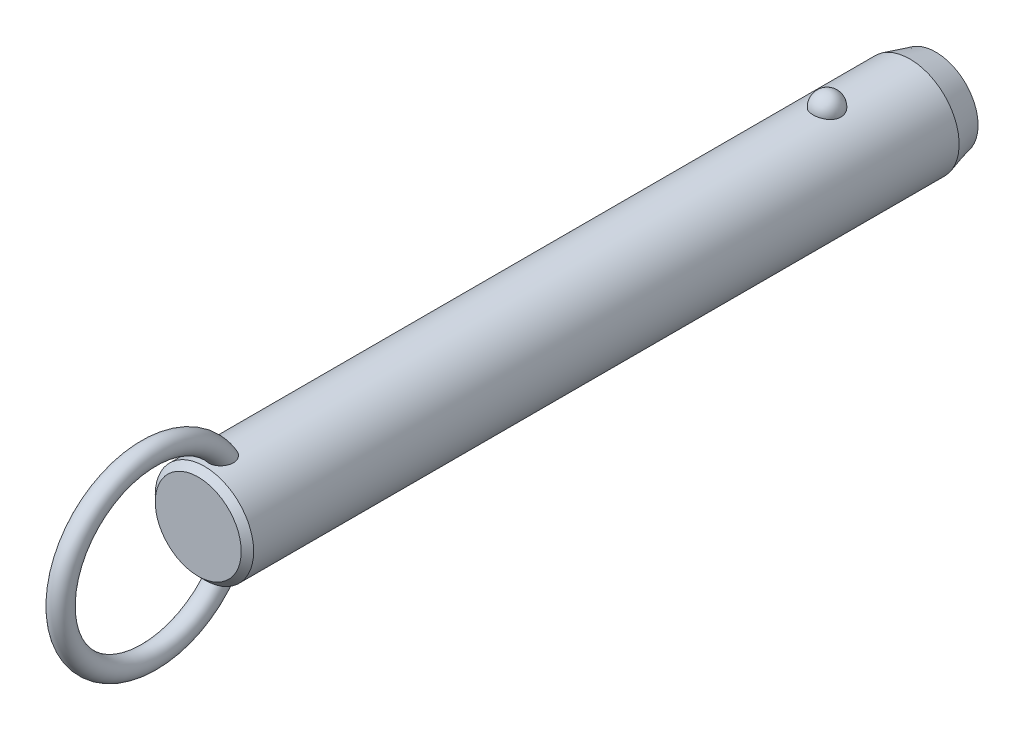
ISO-10303-21;
HEADER;
FILE_DESCRIPTION(('STEP AP214'),'2;1');
FILE_NAME('part.step','',(''),(''),'','','');
FILE_SCHEMA(('AUTOMOTIVE_DESIGN { 1 0 10303 214 1 1 1 1 }'));
ENDSEC;
DATA;
#1=APPLICATION_CONTEXT('core data for automotive mechanical design processes');
#2=APPLICATION_PROTOCOL_DEFINITION('international standard','automotive_design',2000,#1);
#3=PRODUCT_CONTEXT('',#1,'mechanical');
#4=PRODUCT('Part','Part','',(#3));
#5=PRODUCT_RELATED_PRODUCT_CATEGORY('part','',(#4));
#6=PRODUCT_DEFINITION_FORMATION('','',#4);
#7=PRODUCT_DEFINITION_CONTEXT('part definition',#1,'design');
#8=PRODUCT_DEFINITION('design','',#6,#7);
#9=PRODUCT_DEFINITION_SHAPE('','',#8);
#10=(LENGTH_UNIT() NAMED_UNIT(*) SI_UNIT(.MILLI.,.METRE.));
#11=(NAMED_UNIT(*) PLANE_ANGLE_UNIT() SI_UNIT($,.RADIAN.));
#12=(NAMED_UNIT(*) SI_UNIT($,.STERADIAN.) SOLID_ANGLE_UNIT());
#13=UNCERTAINTY_MEASURE_WITH_UNIT(LENGTH_MEASURE(1.E-05),#10,'distance_accuracy_value','');
#14=(GEOMETRIC_REPRESENTATION_CONTEXT(3) GLOBAL_UNCERTAINTY_ASSIGNED_CONTEXT((#13)) GLOBAL_UNIT_ASSIGNED_CONTEXT((#10,
#11,#12)) REPRESENTATION_CONTEXT('',''));
#15=CARTESIAN_POINT('',(0.,0.,0.));
#16=DIRECTION('',(0.,0.,1.));
#17=DIRECTION('',(1.,0.,0.));
#18=AXIS2_PLACEMENT_3D('',#15,#16,#17);
#19=CARTESIAN_POINT('',(0.,0.,109.2));
#20=DIRECTION('',(0.,0.,-1.));
#21=DIRECTION('',(-1.,0.,0.));
#22=AXIS2_PLACEMENT_3D('',#19,#20,#21);
#23=CYLINDRICAL_SURFACE('',#22,9.5);
#24=CARTESIAN_POINT('',(2.67259918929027,9.11631578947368,-2.70000000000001));
#25=CARTESIAN_POINT('',(2.6725968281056,9.11631786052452,-2.54909854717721));
#26=CARTESIAN_POINT('',(2.66030567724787,9.11994722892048,-2.39816735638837));
#27=CARTESIAN_POINT('',(2.6114347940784,9.13405924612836,-2.10058568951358));
#28=CARTESIAN_POINT('',(2.57484658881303,9.14454428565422,-1.95393672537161));
#29=CARTESIAN_POINT('',(2.47830875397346,9.17117631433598,-1.66916069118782));
#30=CARTESIAN_POINT('',(2.41836936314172,9.18732082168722,-1.53102991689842));
#31=CARTESIAN_POINT('',(2.27661331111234,9.22346780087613,-1.26705393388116));
#32=CARTESIAN_POINT('',(2.19479699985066,9.24347021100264,-1.14120852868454));
#33=CARTESIAN_POINT('',(2.01085282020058,9.28522401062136,-0.904632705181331));
#34=CARTESIAN_POINT('',(1.90862396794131,9.30698376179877,-0.793982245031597));
#35=CARTESIAN_POINT('',(1.6867437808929,9.34973971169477,-0.591607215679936));
#36=CARTESIAN_POINT('',(1.56709244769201,9.37073591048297,-0.499882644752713));
#37=CARTESIAN_POINT('',(1.31393976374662,9.40956370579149,-0.338167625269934));
#38=CARTESIAN_POINT('',(1.18048026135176,9.42740444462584,-0.268113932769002));
#39=CARTESIAN_POINT('',(0.903154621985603,9.45799906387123,-0.151390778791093));
#40=CARTESIAN_POINT('',(0.759289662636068,9.47075351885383,-0.104718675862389));
#41=CARTESIAN_POINT('',(0.468074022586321,9.48956256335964,-0.0367633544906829));
#42=CARTESIAN_POINT('',(0.320836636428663,9.49573643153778,-0.0150275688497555));
#43=CARTESIAN_POINT('',(0.0246714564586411,9.50112183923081,0.00396199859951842));
#44=CARTESIAN_POINT('',(-0.124256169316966,9.50033406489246,0.00121819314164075));
#45=CARTESIAN_POINT('',(-0.417264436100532,9.4919475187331,-0.0284441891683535));
#46=CARTESIAN_POINT('',(-0.56138413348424,9.48444885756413,-0.0550074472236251));
#47=CARTESIAN_POINT('',(-0.842986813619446,9.46357853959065,-0.131064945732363));
#48=CARTESIAN_POINT('',(-0.980469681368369,9.450206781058,-0.180559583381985));
#49=CARTESIAN_POINT('',(-1.24585005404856,9.41890822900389,-0.301476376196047));
#50=CARTESIAN_POINT('',(-1.37368611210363,9.40095498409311,-0.373026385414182));
#51=CARTESIAN_POINT('',(-1.61552738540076,9.36242964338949,-0.536025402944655));
#52=CARTESIAN_POINT('',(-1.72953116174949,9.34185727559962,-0.627476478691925));
#53=CARTESIAN_POINT('',(-1.9429225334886,9.29984568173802,-0.829844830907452));
#54=CARTESIAN_POINT('',(-2.04198021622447,9.27839736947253,-0.94110821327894));
#55=CARTESIAN_POINT('',(-2.22026460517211,9.23735994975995,-1.17883414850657));
#56=CARTESIAN_POINT('',(-2.29948985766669,9.21777097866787,-1.30529781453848));
#57=CARTESIAN_POINT('',(-2.43697287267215,9.18238994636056,-1.57158566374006));
#58=CARTESIAN_POINT('',(-2.49497068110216,9.16664569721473,-1.71155057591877));
#59=CARTESIAN_POINT('',(-2.5872073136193,9.14104303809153,-1.99961197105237));
#60=CARTESIAN_POINT('',(-2.62144683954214,9.13118445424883,-2.14770821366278));
#61=CARTESIAN_POINT('',(-2.66521466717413,9.11850622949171,-2.44715424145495));
#62=CARTESIAN_POINT('',(-2.67484831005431,9.11565658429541,-2.59848735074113));
#63=CARTESIAN_POINT('',(-2.66946735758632,9.11723375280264,-2.90067317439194));
#64=CARTESIAN_POINT('',(-2.65445345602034,9.12166036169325,-3.05152590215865));
#65=CARTESIAN_POINT('',(-2.60029711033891,9.13724422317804,-3.34766110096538));
#66=CARTESIAN_POINT('',(-2.56127978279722,9.14836656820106,-3.49296833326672));
#67=CARTESIAN_POINT('',(-2.46018844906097,9.17606676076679,-3.77477535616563));
#68=CARTESIAN_POINT('',(-2.39811349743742,9.1926448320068,-3.9112747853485));
#69=CARTESIAN_POINT('',(-2.25202303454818,9.22952198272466,-4.17244273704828));
#70=CARTESIAN_POINT('',(-2.16788714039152,9.24984129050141,-4.29704106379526));
#71=CARTESIAN_POINT('',(-1.9799408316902,9.29188255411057,-4.53013066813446));
#72=CARTESIAN_POINT('',(-1.87612963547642,9.31360456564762,-4.63862130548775));
#73=CARTESIAN_POINT('',(-1.65105429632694,9.35612959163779,-4.8369029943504));
#74=CARTESIAN_POINT('',(-1.52972405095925,9.37692871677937,-4.92661991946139));
#75=CARTESIAN_POINT('',(-1.27318250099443,9.41518970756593,-5.08429106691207));
#76=CARTESIAN_POINT('',(-1.13797219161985,9.432651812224,-5.15224684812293));
#77=CARTESIAN_POINT('',(-0.859280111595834,9.46208255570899,-5.26371827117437));
#78=CARTESIAN_POINT('',(-0.715925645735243,9.47411833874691,-5.30753421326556));
#79=CARTESIAN_POINT('',(-0.423550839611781,9.4916822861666,-5.37076321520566));
#80=CARTESIAN_POINT('',(-0.2745312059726,9.49721125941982,-5.39017930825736));
#81=CARTESIAN_POINT('',(0.0218446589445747,9.50110860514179,-5.40390587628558));
#82=CARTESIAN_POINT('',(0.16917707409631,9.49961381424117,-5.39869609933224));
#83=CARTESIAN_POINT('',(0.460808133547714,9.48993906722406,-5.36441955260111));
#84=CARTESIAN_POINT('',(0.605106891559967,9.48175936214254,-5.33535367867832));
#85=CARTESIAN_POINT('',(0.886027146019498,9.4596376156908,-5.25435587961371));
#86=CARTESIAN_POINT('',(1.02267710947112,9.44571881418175,-5.20251612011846));
#87=CARTESIAN_POINT('',(1.28523827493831,9.41358993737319,-5.07741549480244));
#88=CARTESIAN_POINT('',(1.41114877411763,9.39537958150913,-5.00415322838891));
#89=CARTESIAN_POINT('',(1.65085227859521,9.3562644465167,-4.83684599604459));
#90=CARTESIAN_POINT('',(1.76442346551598,9.33532178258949,-4.74249218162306));
#91=CARTESIAN_POINT('',(1.97425672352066,9.29321198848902,-4.53620389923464));
#92=CARTESIAN_POINT('',(2.07051582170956,9.27204482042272,-4.42426641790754));
#93=CARTESIAN_POINT('',(2.24490086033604,9.23139221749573,-4.18363183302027));
#94=CARTESIAN_POINT('',(2.32267019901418,9.21194380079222,-4.05466990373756));
#95=CARTESIAN_POINT('',(2.45584092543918,9.1773419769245,-3.78517836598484));
#96=CARTESIAN_POINT('',(2.5112497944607,9.16218713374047,-3.64465264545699));
#97=CARTESIAN_POINT('',(2.59380876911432,9.13913522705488,-3.37104301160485));
#98=CARTESIAN_POINT('',(2.62330266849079,9.13064624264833,-3.23871053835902));
#99=CARTESIAN_POINT('',(2.66269870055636,9.11923566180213,-2.97092664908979));
#100=CARTESIAN_POINT('',(2.67260130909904,9.11631393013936,-2.83547530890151));
#101=CARTESIAN_POINT('',(2.67259918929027,9.11631578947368,-2.70000000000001));
#102=B_SPLINE_CURVE_WITH_KNOTS('',3,(#24,#25,#26,#27,#28,#29,#30,#31,#32,#33,#34,#35,#36,#37,
#38,#39,#40,#41,#42,#43,#44,#45,#46,#47,#48,#49,#50,#51,#52,#53,#54,#55,#56,#57,#58,#59,#60,#61,
#62,#63,#64,#65,#66,#67,#68,#69,#70,#71,#72,#73,#74,#75,#76,#77,#78,#79,#80,#81,#82,#83,#84,#85,
#86,#87,#88,#89,#90,#91,#92,#93,#94,#95,#96,#97,#98,#99,#100,#101),.UNSPECIFIED.,.T.,.F.,(4,2,2,
2,2,2,2,2,2,2,2,2,2,2,2,2,2,2,2,2,2,2,2,2,2,2,2,2,2,2,2,2,2,2,2,2,2,2,4),(0.,0.452217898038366,
0.904593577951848,1.35677112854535,1.80894144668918,2.26340676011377,2.71787203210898,
3.17099820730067,3.62407318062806,4.0687883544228,4.51345969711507,4.95160616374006,
5.38976021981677,5.83050358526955,6.27129275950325,6.72071308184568,7.17016633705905,
7.62495278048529,8.07972578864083,8.53254856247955,8.98535859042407,9.43582813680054,
9.88631615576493,10.3393155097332,10.7923328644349,11.2471065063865,11.7018475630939,
12.150795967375,12.599688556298,13.0398725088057,13.4800399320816,13.9184421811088,
14.3568730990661,14.802202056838,15.2476074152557,15.7010097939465,16.1542603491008,
16.5602594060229,16.966248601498),.UNSPECIFIED.);
#103=CARTESIAN_POINT('',(2.67259918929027,9.11631578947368,-2.70000000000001));
#104=VERTEX_POINT('',#103);
#105=EDGE_CURVE('E41',#104,#104,#102,.T.);
#106=ORIENTED_EDGE('',*,*,#105,.T.);
#107=EDGE_LOOP('',(#106));
#108=FACE_BOUND('',#107,.T.);
#109=CARTESIAN_POINT('',(0.,0.,117.52));
#110=DIRECTION('',(0.,0.,1.));
#111=DIRECTION('',(1.,0.,0.));
#112=AXIS2_PLACEMENT_3D('',#109,#110,#111);
#113=CIRCLE('',#112,9.5);
#114=CARTESIAN_POINT('',(9.5,0.,117.52));
#115=VERTEX_POINT('',#114);
#116=EDGE_CURVE('E10',#115,#115,#113,.F.);
#117=ORIENTED_EDGE('',*,*,#116,.T.);
#118=EDGE_LOOP('',(#117));
#119=FACE_BOUND('',#118,.T.);
#120=CARTESIAN_POINT('',(-0.697062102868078,-9.47439269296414,111.867808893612));
#121=CARTESIAN_POINT('',(-0.799579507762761,-9.46685146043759,111.907482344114));
#122=CARTESIAN_POINT('',(-0.898575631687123,-9.45788043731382,111.9559309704));
#123=CARTESIAN_POINT('',(-1.08670047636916,-9.43811593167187,112.068868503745));
#124=CARTESIAN_POINT('',(-1.17583204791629,-9.42732297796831,112.133352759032));
#125=CARTESIAN_POINT('',(-1.34179806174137,-9.40513672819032,112.276209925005));
#126=CARTESIAN_POINT('',(-1.41865133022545,-9.39374438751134,112.354561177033));
#127=CARTESIAN_POINT('',(-1.55860047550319,-9.37154196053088,112.522752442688));
#128=CARTESIAN_POINT('',(-1.62169476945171,-9.3607319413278,112.61259377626));
#129=CARTESIAN_POINT('',(-1.73527695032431,-9.34035749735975,112.804500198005));
#130=CARTESIAN_POINT('',(-1.78522266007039,-9.33085270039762,112.906891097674));
#131=CARTESIAN_POINT('',(-1.86924997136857,-9.3143834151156,113.118148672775));
#132=CARTESIAN_POINT('',(-1.90332570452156,-9.30741986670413,113.227017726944));
#133=CARTESIAN_POINT('',(-1.95893603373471,-9.29588482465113,113.460473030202));
#134=CARTESIAN_POINT('',(-1.97872420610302,-9.29165182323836,113.585489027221));
#135=CARTESIAN_POINT('',(-2.00062129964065,-9.28695978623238,113.837080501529));
#136=CARTESIAN_POINT('',(-2.00272284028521,-9.28650232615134,113.963656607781));
#137=CARTESIAN_POINT('',(-1.98958876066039,-9.28932750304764,114.236815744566));
#138=CARTESIAN_POINT('',(-1.97143366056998,-9.2932400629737,114.383251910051));
#139=CARTESIAN_POINT('',(-1.91479925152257,-9.30507151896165,114.672062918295));
#140=CARTESIAN_POINT('',(-1.87629122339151,-9.31299607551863,114.814431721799));
#141=CARTESIAN_POINT('',(-1.7722568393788,-9.33340232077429,115.115172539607));
#142=CARTESIAN_POINT('',(-1.70334898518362,-9.34641636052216,115.272369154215));
#143=CARTESIAN_POINT('',(-1.58111062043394,-9.36759153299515,115.497517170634));
#144=CARTESIAN_POINT('',(-1.53721459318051,-9.37492619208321,115.570796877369));
#145=CARTESIAN_POINT('',(-1.4430263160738,-9.38988566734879,115.71307405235));
#146=CARTESIAN_POINT('',(-1.39273721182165,-9.39751033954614,115.782073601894));
#147=CARTESIAN_POINT('',(-1.26775962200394,-9.41530678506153,115.936983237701));
#148=CARTESIAN_POINT('',(-1.19052326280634,-9.42548108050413,116.020871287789));
#149=CARTESIAN_POINT('',(-1.0242024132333,-9.44499825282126,116.176008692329));
#150=CARTESIAN_POINT('',(-0.935139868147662,-9.45434261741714,116.247280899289));
#151=CARTESIAN_POINT('',(-0.766610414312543,-9.46930670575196,116.358695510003));
#152=CARTESIAN_POINT('',(-0.689439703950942,-9.47529223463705,116.402235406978));
#153=CARTESIAN_POINT('',(-0.528942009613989,-9.48560294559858,116.47631336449));
#154=CARTESIAN_POINT('',(-0.445620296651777,-9.48992953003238,116.506862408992));
#155=CARTESIAN_POINT('',(-0.273901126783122,-9.49644161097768,116.552579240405));
#156=CARTESIAN_POINT('',(-0.185465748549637,-9.49860811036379,116.56761059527));
#157=CARTESIAN_POINT('',(-0.00734541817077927,-9.5004135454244,116.580149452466));
#158=CARTESIAN_POINT('',(0.0823387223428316,-9.50005405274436,116.577667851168));
#159=CARTESIAN_POINT('',(0.247679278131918,-9.49708301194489,116.556995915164));
#160=CARTESIAN_POINT('',(0.32362017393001,-9.49477609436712,116.540930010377));
#161=CARTESIAN_POINT('',(0.47198153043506,-9.48855917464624,116.497172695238));
#162=CARTESIAN_POINT('',(0.54440029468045,-9.48464840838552,116.469475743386));
#163=CARTESIAN_POINT('',(0.708947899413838,-9.47398336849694,116.39280266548));
#164=CARTESIAN_POINT('',(0.799149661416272,-9.46671310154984,116.339774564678));
#165=CARTESIAN_POINT('',(0.969783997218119,-9.45076225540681,116.219973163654));
#166=CARTESIAN_POINT('',(1.05019415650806,-9.44207854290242,116.153169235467));
#167=CARTESIAN_POINT('',(1.23092343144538,-9.42051459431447,115.980759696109));
#168=CARTESIAN_POINT('',(1.32652499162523,-9.40733378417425,115.87026193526));
#169=CARTESIAN_POINT('',(1.49893121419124,-9.3814074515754,115.635561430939));
#170=CARTESIAN_POINT('',(1.57571616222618,-9.36866239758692,115.511344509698));
#171=CARTESIAN_POINT('',(1.71285426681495,-9.34457644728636,115.249389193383));
#172=CARTESIAN_POINT('',(1.7726636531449,-9.33328726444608,115.11136233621));
#173=CARTESIAN_POINT('',(1.87239208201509,-9.31379209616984,114.828051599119));
#174=CARTESIAN_POINT('',(1.91230158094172,-9.3055875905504,114.682764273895));
#175=CARTESIAN_POINT('',(1.97604189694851,-9.29228394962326,114.362028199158));
#176=CARTESIAN_POINT('',(1.99587438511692,-9.28797202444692,114.185724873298));
#177=CARTESIAN_POINT('',(2.0029570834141,-9.28645519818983,113.832414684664));
#178=CARTESIAN_POINT('',(1.99025930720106,-9.28923895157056,113.655409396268));
#179=CARTESIAN_POINT('',(1.93735479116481,-9.30038134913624,113.356338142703));
#180=CARTESIAN_POINT('',(1.90576827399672,-9.30697680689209,113.232667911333));
#181=CARTESIAN_POINT('',(1.82287484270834,-9.32356855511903,112.992329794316));
#182=CARTESIAN_POINT('',(1.77158213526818,-9.33356239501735,112.875656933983));
#183=CARTESIAN_POINT('',(1.64885744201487,-9.35602275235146,112.652706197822));
#184=CARTESIAN_POINT('',(1.57730995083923,-9.36850332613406,112.546492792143));
#185=CARTESIAN_POINT('',(1.41543264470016,-9.39431873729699,112.349553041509));
#186=CARTESIAN_POINT('',(1.3251088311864,-9.40765330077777,112.258821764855));
#187=CARTESIAN_POINT('',(1.13846223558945,-9.43195720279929,112.105033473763));
#188=CARTESIAN_POINT('',(1.04369890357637,-9.44302894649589,112.040094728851));
#189=CARTESIAN_POINT('',(0.84396568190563,-9.46296805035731,111.928038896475));
#190=CARTESIAN_POINT('',(0.73900000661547,-9.4718363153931,111.880914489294));
#191=CARTESIAN_POINT('',(0.52817529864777,-9.48586140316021,111.808117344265));
#192=CARTESIAN_POINT('',(0.422686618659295,-9.49119633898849,111.78140249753));
#193=CARTESIAN_POINT('',(0.208590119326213,-9.49831365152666,111.746013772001));
#194=CARTESIAN_POINT('',(0.0999817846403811,-9.500095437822,111.737342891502));
#195=CARTESIAN_POINT('',(-0.126104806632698,-9.49988861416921,111.738350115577));
#196=CARTESIAN_POINT('',(-0.243578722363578,-9.49757821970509,111.749594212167));
#197=CARTESIAN_POINT('',(-0.474390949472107,-9.48885165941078,111.793167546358));
#198=CARTESIAN_POINT('',(-0.587729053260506,-9.48243528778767,111.825497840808));
#199=CARTESIAN_POINT('',(-0.697062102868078,-9.47439269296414,111.867808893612));
#200=B_SPLINE_CURVE_WITH_KNOTS('',3,(#120,#121,#122,#123,#124,#125,#126,#127,#128,#129,#130,
#131,#132,#133,#134,#135,#136,#137,#138,#139,#140,#141,#142,#143,#144,#145,#146,#147,#148,#149,
#150,#151,#152,#153,#154,#155,#156,#157,#158,#159,#160,#161,#162,#163,#164,#165,#166,#167,#168,
#169,#170,#171,#172,#173,#174,#175,#176,#177,#178,#179,#180,#181,#182,#183,#184,#185,#186,#187,
#188,#189,#190,#191,#192,#193,#194,#195,#196,#197,#198,#199),.UNSPECIFIED.,.T.,.F.,(4,2,2,2,2,2,
2,2,2,2,2,2,2,2,2,2,2,2,2,2,2,2,2,2,2,2,2,2,2,2,2,2,2,2,2,2,2,2,2,4),(0.,0.330119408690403,
0.660143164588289,0.98965593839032,1.31920659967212,1.66074728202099,2.00241415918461,
2.3808869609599,2.7595176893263,3.20065679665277,3.64242004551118,4.15620996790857,
4.41314162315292,4.66994734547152,5.0122866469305,5.35399933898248,5.61943037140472,
5.88463652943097,6.15215502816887,6.41950709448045,6.6514439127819,6.88349136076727,
7.19641200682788,7.51003602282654,7.94779711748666,8.38601491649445,8.83699707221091,
9.28819530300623,9.81778662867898,10.3465317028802,10.7284172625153,11.1100280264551,
11.4938603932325,11.8775702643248,12.2220189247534,12.5663259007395,12.8915939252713,
13.2169159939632,13.5689650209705,13.9210316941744),.UNSPECIFIED.);
#201=CARTESIAN_POINT('',(-0.697062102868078,-9.47439269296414,111.867808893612));
#202=VERTEX_POINT('',#201);
#203=EDGE_CURVE('E60',#202,#202,#200,.T.);
#204=ORIENTED_EDGE('',*,*,#203,.T.);
#205=EDGE_LOOP('',(#204));
#206=FACE_BOUND('',#205,.T.);
#207=CARTESIAN_POINT('',(-0.697062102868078,9.47439269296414,111.867808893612));
#208=CARTESIAN_POINT('',(-0.597792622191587,9.48169483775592,111.82939564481));
#209=CARTESIAN_POINT('',(-0.495106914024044,9.48766580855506,111.799168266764));
#210=CARTESIAN_POINT('',(-0.285876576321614,9.49627648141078,111.756032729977));
#211=CARTESIAN_POINT('',(-0.179324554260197,9.49890941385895,111.743159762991));
#212=CARTESIAN_POINT('',(0.0344157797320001,9.50053798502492,111.735166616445));
#213=CARTESIAN_POINT('',(0.141603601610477,9.49953613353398,111.740034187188));
#214=CARTESIAN_POINT('',(0.353563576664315,9.49401038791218,111.767365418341));
#215=CARTESIAN_POINT('',(0.458336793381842,9.48948807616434,111.78982117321));
#216=CARTESIAN_POINT('',(0.66249373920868,9.4774236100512,111.851671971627));
#217=CARTESIAN_POINT('',(0.761881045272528,9.46988348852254,111.891055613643));
#218=CARTESIAN_POINT('',(0.952608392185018,9.45260382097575,111.985634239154));
#219=CARTESIAN_POINT('',(1.04394806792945,9.44286417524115,112.040829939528));
#220=CARTESIAN_POINT('',(1.21712767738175,9.4221176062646,112.166066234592));
#221=CARTESIAN_POINT('',(1.29885671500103,9.41109835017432,112.236257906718));
#222=CARTESIAN_POINT('',(1.4497897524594,9.38903310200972,112.388980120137));
#223=CARTESIAN_POINT('',(1.51899278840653,9.37798710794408,112.471511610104));
#224=CARTESIAN_POINT('',(1.64602857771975,9.35654375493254,112.649776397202));
#225=CARTESIAN_POINT('',(1.70333052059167,9.34618688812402,112.745891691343));
#226=CARTESIAN_POINT('',(1.80259341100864,9.32755128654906,112.945897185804));
#227=CARTESIAN_POINT('',(1.84454942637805,9.31927322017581,113.049789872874));
#228=CARTESIAN_POINT('',(1.91637039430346,9.30478365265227,113.272213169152));
#229=CARTESIAN_POINT('',(1.944805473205,9.29882552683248,113.391219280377));
#230=CARTESIAN_POINT('',(1.98449865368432,9.29043398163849,113.632143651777));
#231=CARTESIAN_POINT('',(1.99574908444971,9.28800213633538,113.754063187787));
#232=CARTESIAN_POINT('',(2.00275141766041,9.28649645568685,114.016932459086));
#233=CARTESIAN_POINT('',(1.99588238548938,9.28799035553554,114.157952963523));
#234=CARTESIAN_POINT('',(1.96270559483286,9.29505517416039,114.437621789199));
#235=CARTESIAN_POINT('',(1.93637872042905,9.30063010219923,114.576267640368));
#236=CARTESIAN_POINT('',(1.85949176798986,9.31633564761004,114.872561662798));
#237=CARTESIAN_POINT('',(1.80549792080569,9.3270926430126,115.029290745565));
#238=CARTESIAN_POINT('',(1.67376869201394,9.3516306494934,115.332284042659));
#239=CARTESIAN_POINT('',(1.5960318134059,9.36541185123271,115.478547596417));
#240=CARTESIAN_POINT('',(1.4360277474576,9.39110706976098,115.725813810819));
#241=CARTESIAN_POINT('',(1.35831795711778,9.40278656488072,115.829791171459));
#242=CARTESIAN_POINT('',(1.18774483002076,9.42585025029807,116.024534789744));
#243=CARTESIAN_POINT('',(1.09490932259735,9.43723493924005,116.115324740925));
#244=CARTESIAN_POINT('',(0.921110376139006,9.45552616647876,116.25620334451));
#245=CARTESIAN_POINT('',(0.843738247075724,9.46281058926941,116.310656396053));
#246=CARTESIAN_POINT('',(0.681245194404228,9.47589120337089,116.406711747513));
#247=CARTESIAN_POINT('',(0.596135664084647,9.48168953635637,116.448332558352));
#248=CARTESIAN_POINT('',(0.433779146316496,9.49038144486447,116.510089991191));
#249=CARTESIAN_POINT('',(0.35745955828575,9.49359170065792,116.53260136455));
#250=CARTESIAN_POINT('',(0.202074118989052,9.49816761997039,116.564574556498));
#251=CARTESIAN_POINT('',(0.123010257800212,9.49953459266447,116.574045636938));
#252=CARTESIAN_POINT('',(-0.0357372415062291,9.50026497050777,116.579114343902));
#253=CARTESIAN_POINT('',(-0.115421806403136,9.49962433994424,116.574684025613));
#254=CARTESIAN_POINT('',(-0.272823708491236,9.49640854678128,116.552296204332));
#255=CARTESIAN_POINT('',(-0.350540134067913,9.4938325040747,116.534332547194));
#256=CARTESIAN_POINT('',(-0.500580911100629,9.4870946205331,116.486802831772));
#257=CARTESIAN_POINT('',(-0.572979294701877,9.48296359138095,116.457461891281));
#258=CARTESIAN_POINT('',(-0.712864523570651,9.47347609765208,116.389008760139));
#259=CARTESIAN_POINT('',(-0.780349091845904,9.46811906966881,116.349892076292));
#260=CARTESIAN_POINT('',(-0.946309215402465,9.45329720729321,116.239432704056));
#261=CARTESIAN_POINT('',(-1.04090230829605,9.44321512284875,116.162329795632));
#262=CARTESIAN_POINT('',(-1.21661929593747,9.42219227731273,115.99409718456));
#263=CARTESIAN_POINT('',(-1.29770519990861,9.41124921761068,115.902929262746));
#264=CARTESIAN_POINT('',(-1.47319646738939,9.38563439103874,115.676162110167));
#265=CARTESIAN_POINT('',(-1.5620887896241,9.37102009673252,115.536289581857));
#266=CARTESIAN_POINT('',(-1.71623987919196,9.34401559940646,115.243950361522));
#267=CARTESIAN_POINT('',(-1.78147866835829,9.33162728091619,115.091473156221));
#268=CARTESIAN_POINT('',(-1.88853837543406,9.31055541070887,114.775647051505));
#269=CARTESIAN_POINT('',(-1.92998995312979,9.30193076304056,114.612168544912));
#270=CARTESIAN_POINT('',(-1.98590726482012,9.29015757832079,114.280526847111));
#271=CARTESIAN_POINT('',(-2.00040705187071,9.2870021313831,114.112369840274));
#272=CARTESIAN_POINT('',(-1.99964701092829,9.28716218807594,113.805080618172));
#273=CARTESIAN_POINT('',(-1.98908145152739,9.28945704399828,113.665936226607));
#274=CARTESIAN_POINT('',(-1.94566294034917,9.29865169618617,113.391153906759));
#275=CARTESIAN_POINT('',(-1.91282062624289,9.30554929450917,113.255514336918));
#276=CARTESIAN_POINT('',(-1.84582133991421,9.31898248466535,113.057802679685));
#277=CARTESIAN_POINT('',(-1.8203808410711,9.32400364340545,112.992583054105));
#278=CARTESIAN_POINT('',(-1.76350511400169,9.33492884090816,112.864903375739));
#279=CARTESIAN_POINT('',(-1.7320730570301,9.3408324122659,112.802441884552));
#280=CARTESIAN_POINT('',(-1.66324243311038,9.353333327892,112.68094078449));
#281=CARTESIAN_POINT('',(-1.62584239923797,9.35993084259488,112.621902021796));
#282=CARTESIAN_POINT('',(-1.545276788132,9.37356864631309,112.507987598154));
#283=CARTESIAN_POINT('',(-1.50211241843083,9.38060884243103,112.453111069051));
#284=CARTESIAN_POINT('',(-1.37681147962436,9.40004442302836,112.309961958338));
#285=CARTESIAN_POINT('',(-1.28916358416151,9.41261047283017,112.226429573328));
#286=CARTESIAN_POINT('',(-1.09996826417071,9.43658180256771,112.077236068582));
#287=CARTESIAN_POINT('',(-0.998461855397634,9.44799034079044,112.011523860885));
#288=CARTESIAN_POINT('',(-0.860188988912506,9.46103017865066,111.9394367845));
#289=CARTESIAN_POINT('',(-0.828141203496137,9.46389141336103,111.923851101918));
#290=CARTESIAN_POINT('',(-0.763210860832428,9.46934915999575,111.894473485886));
#291=CARTESIAN_POINT('',(-0.730328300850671,9.47194567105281,111.880681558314));
#292=CARTESIAN_POINT('',(-0.697062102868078,9.47439269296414,111.867808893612));
#293=B_SPLINE_CURVE_WITH_KNOTS('',3,(#207,#208,#209,#210,#211,#212,#213,#214,#215,#216,#217,
#218,#219,#220,#221,#222,#223,#224,#225,#226,#227,#228,#229,#230,#231,#232,#233,#234,#235,#236,
#237,#238,#239,#240,#241,#242,#243,#244,#245,#246,#247,#248,#249,#250,#251,#252,#253,#254,#255,
#256,#257,#258,#259,#260,#261,#262,#263,#264,#265,#266,#267,#268,#269,#270,#271,#272,#273,#274,
#275,#276,#277,#278,#279,#280,#281,#282,#283,#284,#285,#286,#287,#288,#289,#290,#291,#292),
.UNSPECIFIED.,.T.,.F.,(4,2,2,2,2,2,2,2,2,2,2,2,2,2,2,2,2,2,2,2,2,2,2,2,2,2,2,2,2,2,2,2,2,2,2,2,
2,2,2,2,2,2,4),(0.,0.319942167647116,0.640532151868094,0.96090081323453,1.28112555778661,
1.60113495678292,1.92115886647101,2.24457323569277,2.56801248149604,2.90371927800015,
3.23953387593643,3.60560313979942,3.97183576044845,4.39383693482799,4.81625324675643,
5.31257045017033,5.80891895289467,6.19868344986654,6.58773876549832,6.87145417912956,
7.15475838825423,7.3926375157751,7.63034760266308,7.8685358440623,8.10683246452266,
8.34063661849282,8.57454843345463,8.93983939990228,9.30614105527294,9.80266668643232,
10.2996107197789,10.8040753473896,11.3079021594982,11.7249776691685,12.1418541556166,
12.3521485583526,12.562331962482,12.7725671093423,12.9827582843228,13.3458276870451,
13.7078449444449,13.8150604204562,13.9222762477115),.UNSPECIFIED.);
#294=CARTESIAN_POINT('',(-0.697062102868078,9.47439269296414,111.867808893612));
#295=VERTEX_POINT('',#294);
#296=EDGE_CURVE('E68',#295,#295,#293,.T.);
#297=ORIENTED_EDGE('',*,*,#296,.T.);
#298=EDGE_LOOP('',(#297));
#299=FACE_BOUND('',#298,.T.);
#300=CARTESIAN_POINT('',(0.,0.,-18.6999999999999));
#301=DIRECTION('',(0.,0.,-1.));
#302=DIRECTION('',(-1.,0.,0.));
#303=AXIS2_PLACEMENT_3D('',#300,#301,#302);
#304=CIRCLE('',#303,9.5);
#305=CARTESIAN_POINT('',(-9.5,0.,-18.6999999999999));
#306=VERTEX_POINT('',#305);
#307=EDGE_CURVE('E57',#306,#306,#304,.F.);
#308=ORIENTED_EDGE('',*,*,#307,.T.);
#309=EDGE_LOOP('',(#308));
#310=FACE_BOUND('',#309,.T.);
#311=ADVANCED_FACE('F37',(#108,#119,#206,#299,#310),#23,.T.);
#312=CARTESIAN_POINT('',(0.,0.,-23.7));
#313=DIRECTION('',(0.,0.,-1.));
#314=DIRECTION('',(-1.,0.,0.));
#315=AXIS2_PLACEMENT_3D('',#312,#313,#314);
#316=PLANE('',#315);
#317=CARTESIAN_POINT('',(0.,0.,-23.7));
#318=DIRECTION('',(0.,0.,-1.));
#319=DIRECTION('',(-1.,0.,0.));
#320=AXIS2_PLACEMENT_3D('',#317,#318,#319);
#321=CIRCLE('',#320,8.16025403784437);
#322=CARTESIAN_POINT('',(-8.16025403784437,0.,-23.7));
#323=VERTEX_POINT('',#322);
#324=EDGE_CURVE('E67',#323,#323,#321,.T.);
#325=ORIENTED_EDGE('',*,*,#324,.T.);
#326=EDGE_LOOP('',(#325));
#327=FACE_BOUND('',#326,.T.);
#328=ADVANCED_FACE('F86',(#327),#316,.T.);
#329=CARTESIAN_POINT('',(0.,0.,-23.7));
#330=DIRECTION('',(0.,0.,1.));
#331=DIRECTION('',(1.,0.,0.));
#332=AXIS2_PLACEMENT_3D('',#329,#330,#331);
#333=CONICAL_SURFACE('',#332,8.16025403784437,0.261799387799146);
#334=ORIENTED_EDGE('',*,*,#307,.F.);
#335=EDGE_LOOP('',(#334));
#336=FACE_BOUND('',#335,.T.);
#337=ORIENTED_EDGE('',*,*,#324,.F.);
#338=EDGE_LOOP('',(#337));
#339=FACE_BOUND('',#338,.T.);
#340=ADVANCED_FACE('F84',(#336,#339),#333,.T.);
#341=CARTESIAN_POINT('',(0.,0.,118.72));
#342=DIRECTION('',(0.,0.,1.));
#343=DIRECTION('',(1.,0.,0.));
#344=AXIS2_PLACEMENT_3D('',#341,#342,#343);
#345=PLANE('',#344);
#346=CARTESIAN_POINT('',(0.,0.,118.72));
#347=DIRECTION('',(0.,0.,1.));
#348=DIRECTION('',(1.,0.,0.));
#349=AXIS2_PLACEMENT_3D('',#346,#347,#348);
#350=CIRCLE('',#349,8.30000000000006);
#351=CARTESIAN_POINT('',(8.30000000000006,0.,118.72));
#352=VERTEX_POINT('',#351);
#353=EDGE_CURVE('E50',#352,#352,#350,.T.);
#354=ORIENTED_EDGE('',*,*,#353,.T.);
#355=EDGE_LOOP('',(#354));
#356=FACE_BOUND('',#355,.T.);
#357=ADVANCED_FACE('F78',(#356),#345,.T.);
#358=CARTESIAN_POINT('',(0.,0.,128.25));
#359=DIRECTION('',(1.,0.,0.));
#360=DIRECTION('',(0.,0.,-1.));
#361=AXIS2_PLACEMENT_3D('',#358,#359,#360);
#362=TOROIDAL_SURFACE('',#361,17.05,2.);
#363=ORIENTED_EDGE('',*,*,#296,.F.);
#364=EDGE_LOOP('',(#363));
#365=FACE_BOUND('',#364,.T.);
#366=ORIENTED_EDGE('',*,*,#203,.F.);
#367=EDGE_LOOP('',(#366));
#368=FACE_BOUND('',#367,.T.);
#369=ADVANCED_FACE('F74',(#365,#368),#362,.T.);
#370=CARTESIAN_POINT('',(0.,0.,118.72));
#371=DIRECTION('',(0.,0.,-1.));
#372=DIRECTION('',(-1.,0.,0.));
#373=AXIS2_PLACEMENT_3D('',#370,#371,#372);
#374=CONICAL_SURFACE('',#373,8.30000000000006,0.785398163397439);
#375=ORIENTED_EDGE('',*,*,#116,.F.);
#376=EDGE_LOOP('',(#375));
#377=FACE_BOUND('',#376,.T.);
#378=ORIENTED_EDGE('',*,*,#353,.F.);
#379=EDGE_LOOP('',(#378));
#380=FACE_BOUND('',#379,.T.);
#381=ADVANCED_FACE('F39',(#377,#380),#374,.T.);
#382=CARTESIAN_POINT('',(0.,9.5,-2.70000000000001));
#383=DIRECTION('',(0.,1.,0.));
#384=DIRECTION('',(0.,0.,-1.));
#385=AXIS2_PLACEMENT_3D('',#382,#383,#384);
#386=SPHERICAL_SURFACE('',#385,2.7);
#387=ORIENTED_EDGE('',*,*,#105,.F.);
#388=EDGE_LOOP('',(#387));
#389=FACE_BOUND('',#388,.T.);
#390=ADVANCED_FACE('F80',(#389),#386,.T.);
#391=CLOSED_SHELL('',(#311,#328,#340,#357,#369,#381,#390));
#392=MANIFOLD_SOLID_BREP('B2',#391);
#393=ADVANCED_BREP_SHAPE_REPRESENTATION('',(#18,#392),#14);
#394=SHAPE_DEFINITION_REPRESENTATION(#9,#393);
ENDSEC;
END-ISO-10303-21;
